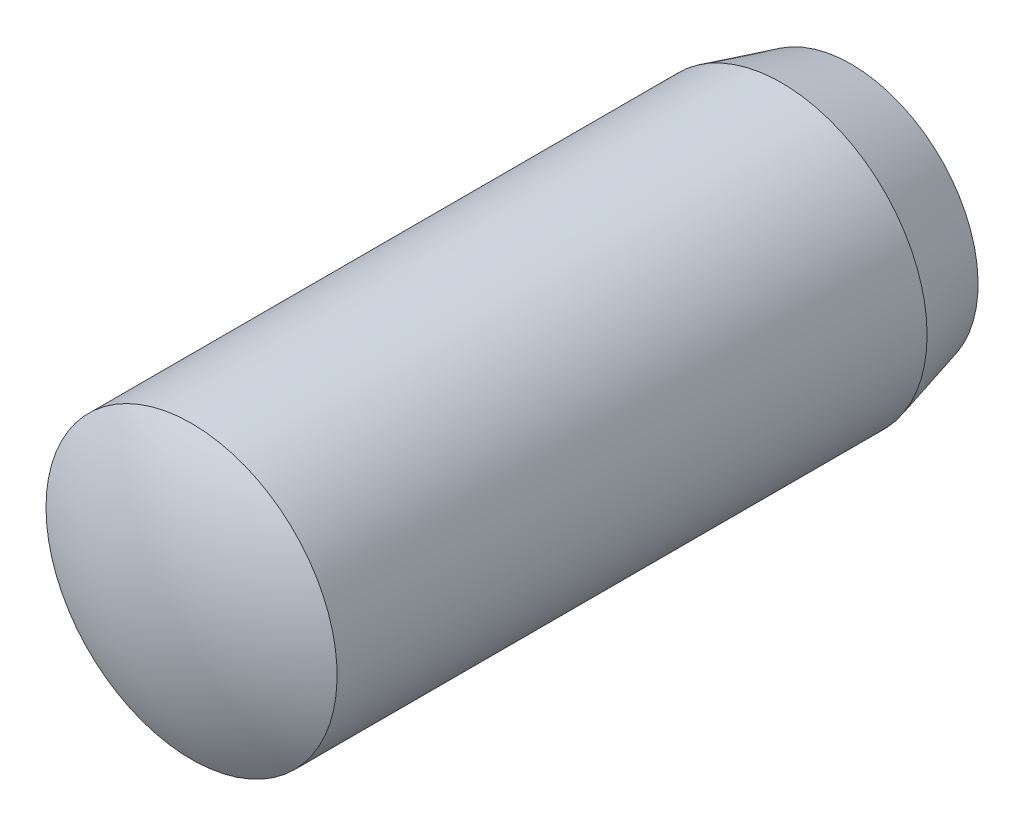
from build123d import *


with BuildPart() as part:
    # Esquisse1 → R_volution1 (revolve)
    with BuildSketch(Plane(origin=(0, 0, 0), x_dir=(0, 0, -1), z_dir=(1, 0, 0))):
        with BuildLine():
            Line((1.07179677, 4), (17.285902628, 4))
            Line((17.285902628, 4), (19.2, 3.487119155))
            ThreePointArc((19.2, 3.487119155), (19.797435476, 1.788854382), (20, 0))
            Line((20, 0), (0, 0))
            ThreePointArc((0, 0), (0.27259339, 2.070552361), (1.07179677, 4))
        make_face()
    revolve(axis=Axis((0, 0, -20), (0, 0, 1)))


solid = part.part
